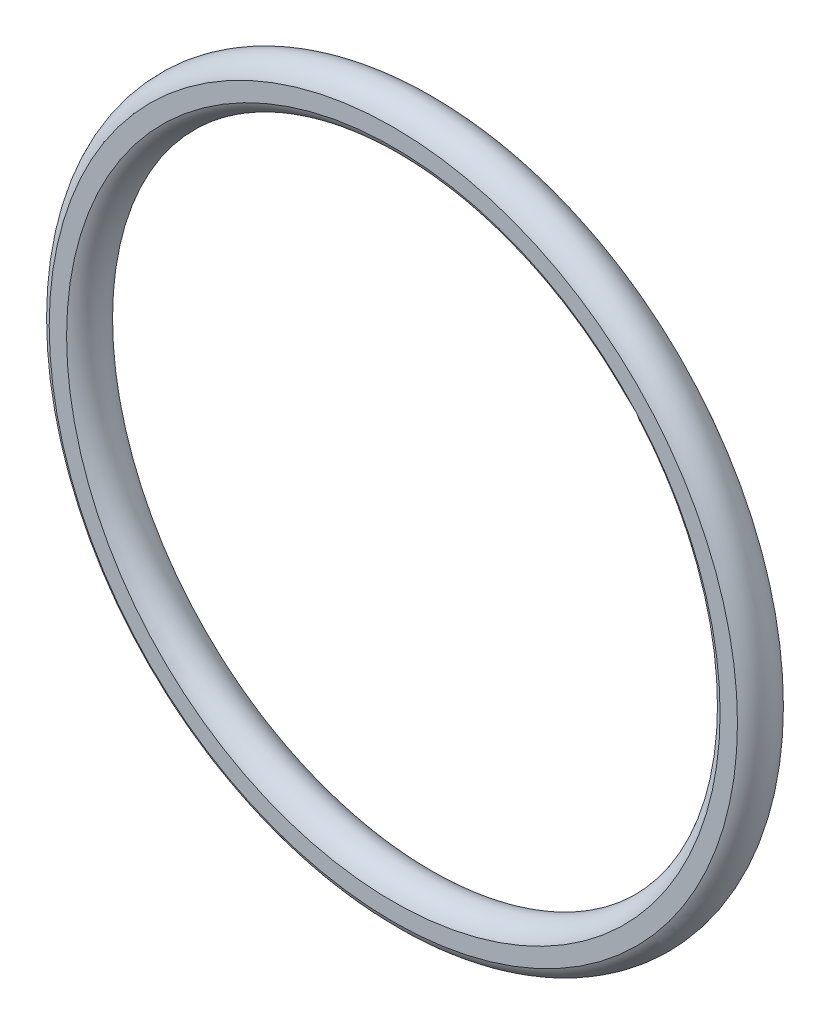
ISO-10303-21;
HEADER;
FILE_DESCRIPTION(('STEP AP214'),'2;1');
FILE_NAME('part.step','',(''),(''),'','','');
FILE_SCHEMA(('AUTOMOTIVE_DESIGN { 1 0 10303 214 1 1 1 1 }'));
ENDSEC;
DATA;
#1=APPLICATION_CONTEXT('core data for automotive mechanical design processes');
#2=APPLICATION_PROTOCOL_DEFINITION('international standard','automotive_design',2000,#1);
#3=PRODUCT_CONTEXT('',#1,'mechanical');
#4=PRODUCT('Part','Part','',(#3));
#5=PRODUCT_RELATED_PRODUCT_CATEGORY('part','',(#4));
#6=PRODUCT_DEFINITION_FORMATION('','',#4);
#7=PRODUCT_DEFINITION_CONTEXT('part definition',#1,'design');
#8=PRODUCT_DEFINITION('design','',#6,#7);
#9=PRODUCT_DEFINITION_SHAPE('','',#8);
#10=(LENGTH_UNIT() NAMED_UNIT(*) SI_UNIT(.MILLI.,.METRE.));
#11=(NAMED_UNIT(*) PLANE_ANGLE_UNIT() SI_UNIT($,.RADIAN.));
#12=(NAMED_UNIT(*) SI_UNIT($,.STERADIAN.) SOLID_ANGLE_UNIT());
#13=UNCERTAINTY_MEASURE_WITH_UNIT(LENGTH_MEASURE(1.E-05),#10,'distance_accuracy_value','');
#14=(GEOMETRIC_REPRESENTATION_CONTEXT(3) GLOBAL_UNCERTAINTY_ASSIGNED_CONTEXT((#13)) GLOBAL_UNIT_ASSIGNED_CONTEXT((#10,
#11,#12)) REPRESENTATION_CONTEXT('',''));
#15=CARTESIAN_POINT('',(0.,0.,0.));
#16=DIRECTION('',(0.,0.,1.));
#17=DIRECTION('',(1.,0.,0.));
#18=AXIS2_PLACEMENT_3D('',#15,#16,#17);
#19=CARTESIAN_POINT('',(0.,0.,0.));
#20=DIRECTION('',(0.,0.,1.));
#21=DIRECTION('',(1.,0.,0.));
#22=AXIS2_PLACEMENT_3D('',#19,#20,#21);
#23=TOROIDAL_SURFACE('',#22,25.3746,1.76530000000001);
#24=CARTESIAN_POINT('',(0.,0.,1.6383));
#25=DIRECTION('',(0.,0.,1.));
#26=DIRECTION('',(1.,0.,0.));
#27=AXIS2_PLACEMENT_3D('',#24,#25,#26);
#28=CIRCLE('',#27,26.0320626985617);
#29=CARTESIAN_POINT('',(26.0320626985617,0.,1.6383));
#30=VERTEX_POINT('',#29);
#31=EDGE_CURVE('E10',#30,#30,#28,.F.);
#32=ORIENTED_EDGE('',*,*,#31,.T.);
#33=EDGE_LOOP('',(#32));
#34=FACE_BOUND('',#33,.T.);
#35=CARTESIAN_POINT('',(0.,0.,1.6383));
#36=DIRECTION('',(0.,0.,-1.));
#37=DIRECTION('',(-1.,0.,0.));
#38=AXIS2_PLACEMENT_3D('',#35,#36,#37);
#39=CIRCLE('',#38,24.7171373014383);
#40=CARTESIAN_POINT('',(-24.7171373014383,0.,1.6383));
#41=VERTEX_POINT('',#40);
#42=EDGE_CURVE('E41',#41,#41,#39,.F.);
#43=ORIENTED_EDGE('',*,*,#42,.T.);
#44=EDGE_LOOP('',(#43));
#45=FACE_BOUND('',#44,.T.);
#46=ADVANCED_FACE('F35',(#34,#45),#23,.T.);
#47=CARTESIAN_POINT('',(0.,0.,1.6383));
#48=DIRECTION('',(0.,0.,1.));
#49=DIRECTION('',(1.,0.,0.));
#50=AXIS2_PLACEMENT_3D('',#47,#48,#49);
#51=PLANE('',#50);
#52=ORIENTED_EDGE('',*,*,#31,.F.);
#53=EDGE_LOOP('',(#52));
#54=FACE_BOUND('',#53,.T.);
#55=ORIENTED_EDGE('',*,*,#42,.F.);
#56=EDGE_LOOP('',(#55));
#57=FACE_BOUND('',#56,.T.);
#58=ADVANCED_FACE('F48',(#54,#57),#51,.T.);
#59=CLOSED_SHELL('',(#46,#58));
#60=MANIFOLD_SOLID_BREP('B2',#59);
#61=ADVANCED_BREP_SHAPE_REPRESENTATION('',(#18,#60),#14);
#62=SHAPE_DEFINITION_REPRESENTATION(#9,#61);
ENDSEC;
END-ISO-10303-21;
